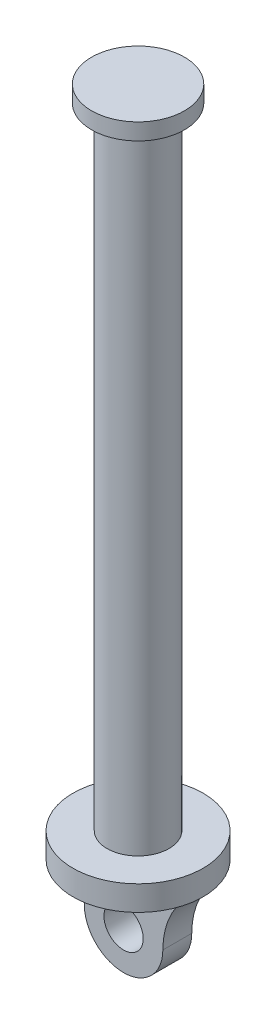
ISO-10303-21;
HEADER;
FILE_DESCRIPTION(('STEP AP214'),'2;1');
FILE_NAME('part.step','',(''),(''),'','','');
FILE_SCHEMA(('AUTOMOTIVE_DESIGN { 1 0 10303 214 1 1 1 1 }'));
ENDSEC;
DATA;
#1=APPLICATION_CONTEXT('core data for automotive mechanical design processes');
#2=APPLICATION_PROTOCOL_DEFINITION('international standard','automotive_design',2000,#1);
#3=PRODUCT_CONTEXT('',#1,'mechanical');
#4=PRODUCT('Part','Part','',(#3));
#5=PRODUCT_RELATED_PRODUCT_CATEGORY('part','',(#4));
#6=PRODUCT_DEFINITION_FORMATION('','',#4);
#7=PRODUCT_DEFINITION_CONTEXT('part definition',#1,'design');
#8=PRODUCT_DEFINITION('design','',#6,#7);
#9=PRODUCT_DEFINITION_SHAPE('','',#8);
#10=(LENGTH_UNIT() NAMED_UNIT(*) SI_UNIT(.MILLI.,.METRE.));
#11=(NAMED_UNIT(*) PLANE_ANGLE_UNIT() SI_UNIT($,.RADIAN.));
#12=(NAMED_UNIT(*) SI_UNIT($,.STERADIAN.) SOLID_ANGLE_UNIT());
#13=UNCERTAINTY_MEASURE_WITH_UNIT(LENGTH_MEASURE(1.E-05),#10,'distance_accuracy_value','');
#14=(GEOMETRIC_REPRESENTATION_CONTEXT(3) GLOBAL_UNCERTAINTY_ASSIGNED_CONTEXT((#13)) GLOBAL_UNIT_ASSIGNED_CONTEXT((#10,
#11,#12)) REPRESENTATION_CONTEXT('',''));
#15=CARTESIAN_POINT('',(0.,0.,0.));
#16=DIRECTION('',(0.,0.,1.));
#17=DIRECTION('',(1.,0.,0.));
#18=AXIS2_PLACEMENT_3D('',#15,#16,#17);
#19=CARTESIAN_POINT('',(0.,-325.,0.));
#20=DIRECTION('',(0.,-1.,0.));
#21=DIRECTION('',(0.,0.,-1.));
#22=AXIS2_PLACEMENT_3D('',#19,#20,#21);
#23=PLANE('',#22);
#24=CARTESIAN_POINT('',(0.,-325.,0.));
#25=DIRECTION('',(0.,-1.,0.));
#26=DIRECTION('',(0.,0.,-1.));
#27=AXIS2_PLACEMENT_3D('',#24,#25,#26);
#28=CIRCLE('',#27,31.5);
#29=CARTESIAN_POINT('',(0.,-325.,-31.5));
#30=VERTEX_POINT('',#29);
#31=EDGE_CURVE('E117',#30,#30,#28,.T.);
#32=ORIENTED_EDGE('',*,*,#31,.T.);
#33=EDGE_LOOP('',(#32));
#34=FACE_BOUND('',#33,.T.);
#35=DIRECTION('',(0.,0.,-1.));
#36=VECTOR('',#35,1.);
#37=CARTESIAN_POINT('',(28.5,-325.,7.));
#38=LINE('',#37,#36);
#39=CARTESIAN_POINT('',(28.5,-325.,7.));
#40=VERTEX_POINT('',#39);
#41=CARTESIAN_POINT('',(28.5,-325.,-7.));
#42=VERTEX_POINT('',#41);
#43=EDGE_CURVE('E98',#40,#42,#38,.T.);
#44=ORIENTED_EDGE('',*,*,#43,.T.);
#45=DIRECTION('',(-1.,0.,0.));
#46=VECTOR('',#45,1.);
#47=CARTESIAN_POINT('',(-28.5,-325.,-7.));
#48=LINE('',#47,#46);
#49=CARTESIAN_POINT('',(-28.5,-325.,-7.));
#50=VERTEX_POINT('',#49);
#51=EDGE_CURVE('E50',#42,#50,#48,.T.);
#52=ORIENTED_EDGE('',*,*,#51,.T.);
#53=DIRECTION('',(0.,0.,-1.));
#54=VECTOR('',#53,1.);
#55=CARTESIAN_POINT('',(-28.5,-325.,7.));
#56=LINE('',#55,#54);
#57=CARTESIAN_POINT('',(-28.5,-325.,7.));
#58=VERTEX_POINT('',#57);
#59=EDGE_CURVE('E76',#58,#50,#56,.T.);
#60=ORIENTED_EDGE('',*,*,#59,.F.);
#61=DIRECTION('',(-1.,0.,0.));
#62=VECTOR('',#61,1.);
#63=CARTESIAN_POINT('',(-28.5,-325.,7.));
#64=LINE('',#63,#62);
#65=EDGE_CURVE('E59',#40,#58,#64,.T.);
#66=ORIENTED_EDGE('',*,*,#65,.F.);
#67=EDGE_LOOP('',(#44,#52,#60,#66));
#68=FACE_BOUND('',#67,.T.);
#69=ADVANCED_FACE('F33',(#34,#68),#23,.T.);
#70=CARTESIAN_POINT('',(0.,-8.,0.));
#71=DIRECTION('',(0.,1.,0.));
#72=DIRECTION('',(0.,0.,1.));
#73=AXIS2_PLACEMENT_3D('',#70,#71,#72);
#74=CYLINDRICAL_SURFACE('',#73,22.5);
#75=CARTESIAN_POINT('',(0.,-8.,0.));
#76=DIRECTION('',(0.,1.,0.));
#77=DIRECTION('',(0.,0.,1.));
#78=AXIS2_PLACEMENT_3D('',#75,#76,#77);
#79=CIRCLE('',#78,22.5);
#80=CARTESIAN_POINT('',(0.,-8.,22.5));
#81=VERTEX_POINT('',#80);
#82=EDGE_CURVE('E42',#81,#81,#79,.T.);
#83=ORIENTED_EDGE('',*,*,#82,.T.);
#84=EDGE_LOOP('',(#83));
#85=FACE_BOUND('',#84,.T.);
#86=CARTESIAN_POINT('',(0.,0.,0.));
#87=DIRECTION('',(0.,1.,0.));
#88=DIRECTION('',(0.,0.,1.));
#89=AXIS2_PLACEMENT_3D('',#86,#87,#88);
#90=CIRCLE('',#89,22.5);
#91=CARTESIAN_POINT('',(0.,0.,22.5));
#92=VERTEX_POINT('',#91);
#93=EDGE_CURVE('E37',#92,#92,#90,.T.);
#94=ORIENTED_EDGE('',*,*,#93,.F.);
#95=EDGE_LOOP('',(#94));
#96=FACE_BOUND('',#95,.T.);
#97=ADVANCED_FACE('F35',(#85,#96),#74,.T.);
#98=CARTESIAN_POINT('',(0.,-8.,0.));
#99=DIRECTION('',(0.,1.,0.));
#100=DIRECTION('',(0.,0.,1.));
#101=AXIS2_PLACEMENT_3D('',#98,#99,#100);
#102=PLANE('',#101);
#103=CARTESIAN_POINT('',(0.,-8.,0.));
#104=DIRECTION('',(0.,-1.,0.));
#105=DIRECTION('',(0.,0.,-1.));
#106=AXIS2_PLACEMENT_3D('',#103,#104,#105);
#107=CIRCLE('',#106,15.);
#108=CARTESIAN_POINT('',(0.,-8.,-15.));
#109=VERTEX_POINT('',#108);
#110=EDGE_CURVE('E11',#109,#109,#107,.T.);
#111=ORIENTED_EDGE('',*,*,#110,.F.);
#112=EDGE_LOOP('',(#111));
#113=FACE_BOUND('',#112,.T.);
#114=ORIENTED_EDGE('',*,*,#82,.F.);
#115=EDGE_LOOP('',(#114));
#116=FACE_BOUND('',#115,.T.);
#117=ADVANCED_FACE('F133',(#113,#116),#102,.F.);
#118=CARTESIAN_POINT('',(0.,0.,0.));
#119=DIRECTION('',(0.,1.,0.));
#120=DIRECTION('',(0.,0.,1.));
#121=AXIS2_PLACEMENT_3D('',#118,#119,#120);
#122=PLANE('',#121);
#123=ORIENTED_EDGE('',*,*,#93,.T.);
#124=EDGE_LOOP('',(#123));
#125=FACE_BOUND('',#124,.T.);
#126=ADVANCED_FACE('F130',(#125),#122,.T.);
#127=CARTESIAN_POINT('',(0.,-313.,0.));
#128=DIRECTION('',(0.,1.,0.));
#129=DIRECTION('',(0.,0.,1.));
#130=AXIS2_PLACEMENT_3D('',#127,#128,#129);
#131=CYLINDRICAL_SURFACE('',#130,15.);
#132=CARTESIAN_POINT('',(0.,-313.,0.));
#133=DIRECTION('',(0.,-1.,0.));
#134=DIRECTION('',(0.,0.,-1.));
#135=AXIS2_PLACEMENT_3D('',#132,#133,#134);
#136=CIRCLE('',#135,15.);
#137=CARTESIAN_POINT('',(0.,-313.,-15.));
#138=VERTEX_POINT('',#137);
#139=EDGE_CURVE('E120',#138,#138,#136,.T.);
#140=ORIENTED_EDGE('',*,*,#139,.F.);
#141=EDGE_LOOP('',(#140));
#142=FACE_BOUND('',#141,.T.);
#143=ORIENTED_EDGE('',*,*,#110,.T.);
#144=EDGE_LOOP('',(#143));
#145=FACE_BOUND('',#144,.T.);
#146=ADVANCED_FACE('F156',(#142,#145),#131,.T.);
#147=CARTESIAN_POINT('',(0.,-325.,0.));
#148=DIRECTION('',(0.,1.,0.));
#149=DIRECTION('',(0.,0.,1.));
#150=AXIS2_PLACEMENT_3D('',#147,#148,#149);
#151=CYLINDRICAL_SURFACE('',#150,31.5);
#152=ORIENTED_EDGE('',*,*,#31,.F.);
#153=EDGE_LOOP('',(#152));
#154=FACE_BOUND('',#153,.T.);
#155=CARTESIAN_POINT('',(0.,-313.,0.));
#156=DIRECTION('',(0.,-1.,0.));
#157=DIRECTION('',(0.,0.,-1.));
#158=AXIS2_PLACEMENT_3D('',#155,#156,#157);
#159=CIRCLE('',#158,31.5);
#160=CARTESIAN_POINT('',(0.,-313.,-31.5));
#161=VERTEX_POINT('',#160);
#162=EDGE_CURVE('E116',#161,#161,#159,.T.);
#163=ORIENTED_EDGE('',*,*,#162,.T.);
#164=EDGE_LOOP('',(#163));
#165=FACE_BOUND('',#164,.T.);
#166=ADVANCED_FACE('F152',(#154,#165),#151,.T.);
#167=CARTESIAN_POINT('',(0.,-313.,0.));
#168=DIRECTION('',(0.,-1.,0.));
#169=DIRECTION('',(0.,0.,-1.));
#170=AXIS2_PLACEMENT_3D('',#167,#168,#169);
#171=PLANE('',#170);
#172=ORIENTED_EDGE('',*,*,#139,.T.);
#173=EDGE_LOOP('',(#172));
#174=FACE_BOUND('',#173,.T.);
#175=ORIENTED_EDGE('',*,*,#162,.F.);
#176=EDGE_LOOP('',(#175));
#177=FACE_BOUND('',#176,.T.);
#178=ADVANCED_FACE('F149',(#174,#177),#171,.F.);
#179=CARTESIAN_POINT('',(-56.6447368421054,-350.,7.));
#180=DIRECTION('',(0.,0.,1.));
#181=DIRECTION('',(1.,0.,0.));
#182=AXIS2_PLACEMENT_3D('',#179,#180,#181);
#183=PLANE('',#182);
#184=CARTESIAN_POINT('',(-56.6447368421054,-350.,7.));
#185=DIRECTION('',(0.,0.,-1.));
#186=DIRECTION('',(1.,0.,0.));
#187=AXIS2_PLACEMENT_3D('',#184,#185,#186);
#188=CIRCLE('',#187,37.6447368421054);
#189=CARTESIAN_POINT('',(-19.,-350.,7.));
#190=VERTEX_POINT('',#189);
#191=EDGE_CURVE('E89',#58,#190,#188,.T.);
#192=ORIENTED_EDGE('',*,*,#191,.T.);
#193=CARTESIAN_POINT('',(0.,-350.,7.));
#194=DIRECTION('',(0.,0.,1.));
#195=DIRECTION('',(1.,0.,0.));
#196=AXIS2_PLACEMENT_3D('',#193,#194,#195);
#197=CIRCLE('',#196,19.);
#198=CARTESIAN_POINT('',(19.,-350.,7.));
#199=VERTEX_POINT('',#198);
#200=EDGE_CURVE('E83',#190,#199,#197,.T.);
#201=ORIENTED_EDGE('',*,*,#200,.T.);
#202=CARTESIAN_POINT('',(56.6447368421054,-350.,7.));
#203=DIRECTION('',(0.,0.,-1.));
#204=DIRECTION('',(1.,0.,0.));
#205=AXIS2_PLACEMENT_3D('',#202,#203,#204);
#206=CIRCLE('',#205,37.6447368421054);
#207=EDGE_CURVE('E87',#199,#40,#206,.T.);
#208=ORIENTED_EDGE('',*,*,#207,.T.);
#209=ORIENTED_EDGE('',*,*,#65,.T.);
#210=EDGE_LOOP('',(#192,#201,#208,#209));
#211=FACE_BOUND('',#210,.T.);
#212=CARTESIAN_POINT('',(0.,-350.,7.));
#213=DIRECTION('',(0.,0.,1.));
#214=DIRECTION('',(1.,0.,0.));
#215=AXIS2_PLACEMENT_3D('',#212,#213,#214);
#216=CIRCLE('',#215,9.5);
#217=CARTESIAN_POINT('',(9.5,-350.,7.));
#218=VERTEX_POINT('',#217);
#219=EDGE_CURVE('E108',#218,#218,#216,.T.);
#220=ORIENTED_EDGE('',*,*,#219,.F.);
#221=EDGE_LOOP('',(#220));
#222=FACE_BOUND('',#221,.T.);
#223=ADVANCED_FACE('F84',(#211,#222),#183,.T.);
#224=CARTESIAN_POINT('',(-56.6447368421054,-350.,-7.));
#225=DIRECTION('',(0.,0.,1.));
#226=DIRECTION('',(1.,0.,0.));
#227=AXIS2_PLACEMENT_3D('',#224,#225,#226);
#228=PLANE('',#227);
#229=CARTESIAN_POINT('',(-56.6447368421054,-350.,-7.));
#230=DIRECTION('',(0.,0.,-1.));
#231=DIRECTION('',(1.,0.,0.));
#232=AXIS2_PLACEMENT_3D('',#229,#230,#231);
#233=CIRCLE('',#232,37.6447368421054);
#234=CARTESIAN_POINT('',(-19.,-350.,-7.));
#235=VERTEX_POINT('',#234);
#236=EDGE_CURVE('E106',#50,#235,#233,.T.);
#237=ORIENTED_EDGE('',*,*,#236,.F.);
#238=ORIENTED_EDGE('',*,*,#51,.F.);
#239=CARTESIAN_POINT('',(56.6447368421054,-350.,-7.));
#240=DIRECTION('',(0.,0.,-1.));
#241=DIRECTION('',(1.,0.,0.));
#242=AXIS2_PLACEMENT_3D('',#239,#240,#241);
#243=CIRCLE('',#242,37.6447368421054);
#244=CARTESIAN_POINT('',(19.,-350.,-7.));
#245=VERTEX_POINT('',#244);
#246=EDGE_CURVE('E110',#245,#42,#243,.T.);
#247=ORIENTED_EDGE('',*,*,#246,.F.);
#248=CARTESIAN_POINT('',(0.,-350.,-7.));
#249=DIRECTION('',(0.,0.,1.));
#250=DIRECTION('',(1.,0.,0.));
#251=AXIS2_PLACEMENT_3D('',#248,#249,#250);
#252=CIRCLE('',#251,19.);
#253=EDGE_CURVE('E95',#235,#245,#252,.T.);
#254=ORIENTED_EDGE('',*,*,#253,.F.);
#255=EDGE_LOOP('',(#237,#238,#247,#254));
#256=FACE_BOUND('',#255,.T.);
#257=CARTESIAN_POINT('',(0.,-350.,-7.));
#258=DIRECTION('',(0.,0.,1.));
#259=DIRECTION('',(1.,0.,0.));
#260=AXIS2_PLACEMENT_3D('',#257,#258,#259);
#261=CIRCLE('',#260,9.5);
#262=CARTESIAN_POINT('',(9.5,-350.,-7.));
#263=VERTEX_POINT('',#262);
#264=EDGE_CURVE('E253',#263,#263,#261,.T.);
#265=ORIENTED_EDGE('',*,*,#264,.T.);
#266=EDGE_LOOP('',(#265));
#267=FACE_BOUND('',#266,.T.);
#268=ADVANCED_FACE('F183',(#256,#267),#228,.F.);
#269=CARTESIAN_POINT('',(-56.6447368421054,-350.,7.));
#270=DIRECTION('',(0.,0.,-1.));
#271=DIRECTION('',(-1.,0.,0.));
#272=AXIS2_PLACEMENT_3D('',#269,#270,#271);
#273=CYLINDRICAL_SURFACE('',#272,37.6447368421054);
#274=ORIENTED_EDGE('',*,*,#236,.T.);
#275=DIRECTION('',(0.,0.,-1.));
#276=VECTOR('',#275,1.);
#277=CARTESIAN_POINT('',(-19.,-350.,7.));
#278=LINE('',#277,#276);
#279=EDGE_CURVE('E97',#190,#235,#278,.T.);
#280=ORIENTED_EDGE('',*,*,#279,.F.);
#281=ORIENTED_EDGE('',*,*,#191,.F.);
#282=ORIENTED_EDGE('',*,*,#59,.T.);
#283=EDGE_LOOP('',(#274,#280,#281,#282));
#284=FACE_BOUND('',#283,.T.);
#285=ADVANCED_FACE('F147',(#284),#273,.F.);
#286=CARTESIAN_POINT('',(0.,-350.,7.));
#287=DIRECTION('',(0.,0.,-1.));
#288=DIRECTION('',(-1.,0.,0.));
#289=AXIS2_PLACEMENT_3D('',#286,#287,#288);
#290=CYLINDRICAL_SURFACE('',#289,19.);
#291=ORIENTED_EDGE('',*,*,#253,.T.);
#292=DIRECTION('',(0.,0.,-1.));
#293=VECTOR('',#292,1.);
#294=CARTESIAN_POINT('',(19.,-350.,7.));
#295=LINE('',#294,#293);
#296=EDGE_CURVE('E93',#199,#245,#295,.T.);
#297=ORIENTED_EDGE('',*,*,#296,.F.);
#298=ORIENTED_EDGE('',*,*,#200,.F.);
#299=ORIENTED_EDGE('',*,*,#279,.T.);
#300=EDGE_LOOP('',(#291,#297,#298,#299));
#301=FACE_BOUND('',#300,.T.);
#302=ADVANCED_FACE('F94',(#301),#290,.T.);
#303=CARTESIAN_POINT('',(56.6447368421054,-350.,7.));
#304=DIRECTION('',(0.,0.,-1.));
#305=DIRECTION('',(-1.,0.,0.));
#306=AXIS2_PLACEMENT_3D('',#303,#304,#305);
#307=CYLINDRICAL_SURFACE('',#306,37.6447368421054);
#308=ORIENTED_EDGE('',*,*,#246,.T.);
#309=ORIENTED_EDGE('',*,*,#43,.F.);
#310=ORIENTED_EDGE('',*,*,#207,.F.);
#311=ORIENTED_EDGE('',*,*,#296,.T.);
#312=EDGE_LOOP('',(#308,#309,#310,#311));
#313=FACE_BOUND('',#312,.T.);
#314=ADVANCED_FACE('F100',(#313),#307,.F.);
#315=CARTESIAN_POINT('',(0.,-350.,7.));
#316=DIRECTION('',(0.,0.,-1.));
#317=DIRECTION('',(-1.,0.,0.));
#318=AXIS2_PLACEMENT_3D('',#315,#316,#317);
#319=CYLINDRICAL_SURFACE('',#318,9.5);
#320=ORIENTED_EDGE('',*,*,#219,.T.);
#321=EDGE_LOOP('',(#320));
#322=FACE_BOUND('',#321,.T.);
#323=ORIENTED_EDGE('',*,*,#264,.F.);
#324=EDGE_LOOP('',(#323));
#325=FACE_BOUND('',#324,.T.);
#326=ADVANCED_FACE('F206',(#322,#325),#319,.F.);
#327=CLOSED_SHELL('',(#69,#97,#117,#126,#146,#166,#178,#223,#268,#285,#302,#314,#326));
#328=MANIFOLD_SOLID_BREP('B2',#327);
#329=ADVANCED_BREP_SHAPE_REPRESENTATION('',(#18,#328),#14);
#330=SHAPE_DEFINITION_REPRESENTATION(#9,#329);
ENDSEC;
END-ISO-10303-21;
